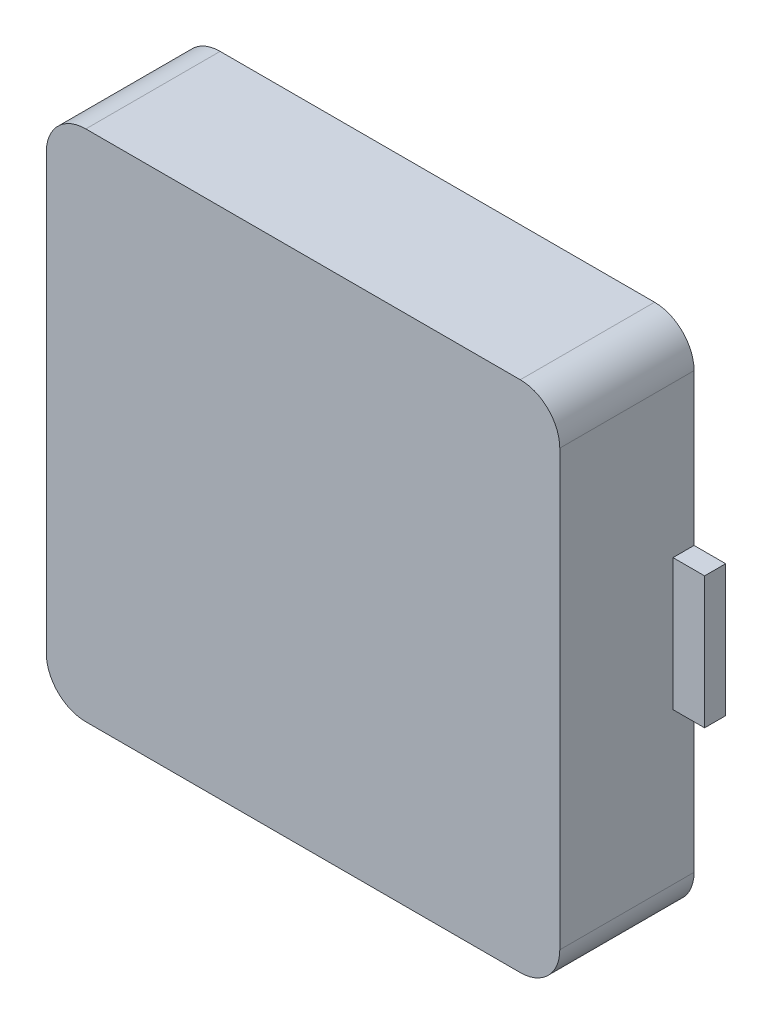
from build123d import *

# Parameters (mm, degrees)
SKETCH_1_W      = 19.5
SKETCH_1_H      = 19.5
EXTRUDE_1_DEPTH = 0.6
SKETCH_5_W      = 19.5
SKETCH_5_H      = 19.5
SKETCH_5_R      = 5.550592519
EXTRUDE_2_DEPTH = 4.5
FILLET_1_R      = 1.5
SKETCH_7_W      = 1.2
SKETCH_7_H      = 5
SKETCH_7_H_2    = 4
EXTRUDE_3_DEPTH = 0.8


with BuildPart() as part:
    # Sketch 1 → Extrude 1 (new body)
    with BuildSketch(Plane.XY):
        Rectangle(SKETCH_1_W, SKETCH_1_H)
    extrude(amount=EXTRUDE_1_DEPTH)

    # Sketch 3 → Revolve 1 (revolve)
    with BuildSketch(Plane(origin=(0, 0, 0), x_dir=(0, 0, -1), z_dir=(1, 0, 0)), mode=Mode.PRIVATE) as revolve_1_sk:
        Polygon((0, 3.15), (4.5, 3.25), (4.5, 5.650592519), (0, 5.550592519), align=None)
    revolve(revolve_1_sk.sketch.rotate(Axis((0, 0, 0), (0, 0, -1)), 90), axis=Axis((0, 0, 0), (0, 0, -1)))

    # Sketch 5 → Extrude 2 (add)
    with BuildSketch(Plane(origin=(0, 0, 0), x_dir=(-1, 0, 0), z_dir=(0, 0, -1))):
        Rectangle(SKETCH_5_W, SKETCH_5_H)
        Circle(SKETCH_5_R, mode=Mode.SUBTRACT)
    extrude(amount=EXTRUDE_2_DEPTH)

    # Fillet 1
    fillet_1_edges = [part.edges().sort_by_distance(p)[0] for p in [
        (9.75, -9.75, -1.95),
        (-9.75, -9.75, -1.95),
        (-9.75, 9.75, -1.95),
        (9.75, 9.75, -1.95),
    ]]
    fillet(fillet_1_edges, radius=FILLET_1_R)

    # Sketch 7 → Extrude 3 (add)
    with BuildSketch(Plane(origin=(0, 0, -4.5), x_dir=(-1, 0, 0), z_dir=(0, 0, -1))):
        with Locations((-10.35, 0)):
            Rectangle(SKETCH_7_W, SKETCH_7_H)
        with Locations((10.35, 5.5)):
            Rectangle(SKETCH_7_W, SKETCH_7_H_2)
        with Locations((10.35, -5.5)):
            Rectangle(SKETCH_7_W, SKETCH_7_H_2)
    extrude(amount=-EXTRUDE_3_DEPTH)


solid = part.part
